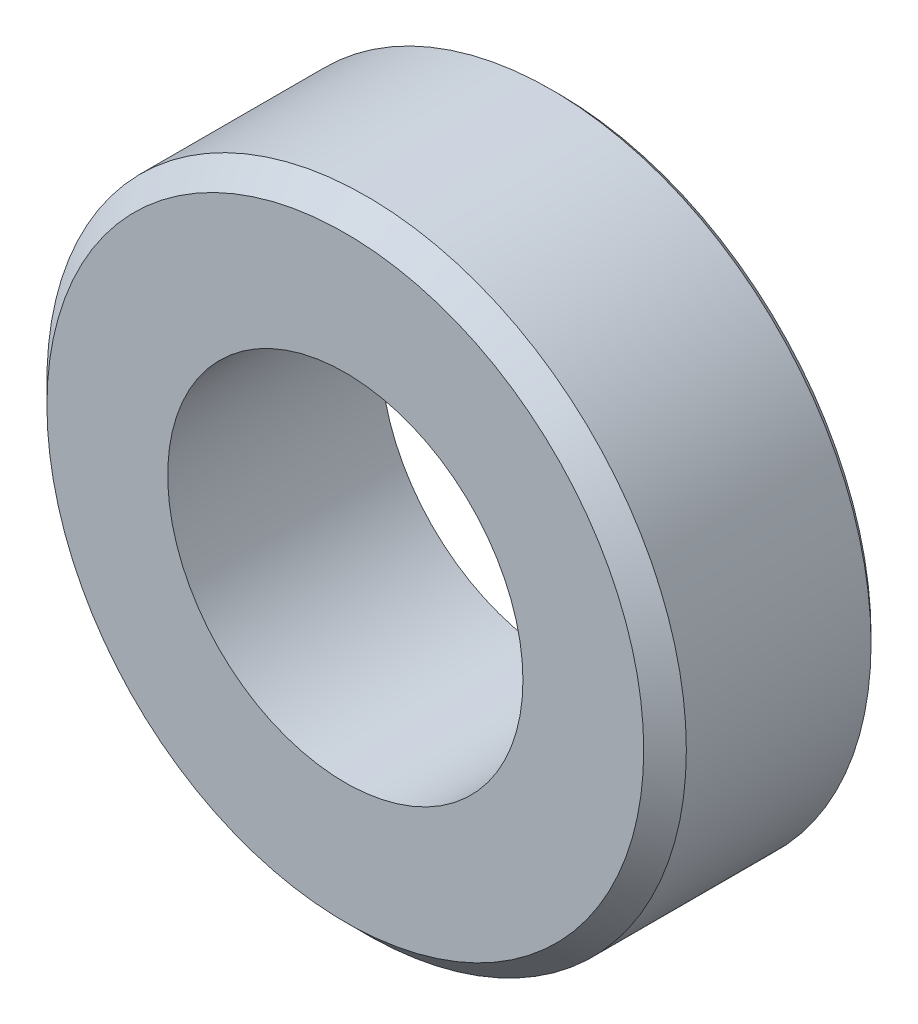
ISO-10303-21;
HEADER;
FILE_DESCRIPTION(('STEP AP214'),'2;1');
FILE_NAME('part.step','',(''),(''),'','','');
FILE_SCHEMA(('AUTOMOTIVE_DESIGN { 1 0 10303 214 1 1 1 1 }'));
ENDSEC;
DATA;
#1=APPLICATION_CONTEXT('core data for automotive mechanical design processes');
#2=APPLICATION_PROTOCOL_DEFINITION('international standard','automotive_design',2000,#1);
#3=PRODUCT_CONTEXT('',#1,'mechanical');
#4=PRODUCT('Part','Part','',(#3));
#5=PRODUCT_RELATED_PRODUCT_CATEGORY('part','',(#4));
#6=PRODUCT_DEFINITION_FORMATION('','',#4);
#7=PRODUCT_DEFINITION_CONTEXT('part definition',#1,'design');
#8=PRODUCT_DEFINITION('design','',#6,#7);
#9=PRODUCT_DEFINITION_SHAPE('','',#8);
#10=(LENGTH_UNIT() NAMED_UNIT(*) SI_UNIT(.MILLI.,.METRE.));
#11=(NAMED_UNIT(*) PLANE_ANGLE_UNIT() SI_UNIT($,.RADIAN.));
#12=(NAMED_UNIT(*) SI_UNIT($,.STERADIAN.) SOLID_ANGLE_UNIT());
#13=UNCERTAINTY_MEASURE_WITH_UNIT(LENGTH_MEASURE(1.E-05),#10,'distance_accuracy_value','');
#14=(GEOMETRIC_REPRESENTATION_CONTEXT(3) GLOBAL_UNCERTAINTY_ASSIGNED_CONTEXT((#13)) GLOBAL_UNIT_ASSIGNED_CONTEXT((#10,
#11,#12)) REPRESENTATION_CONTEXT('',''));
#15=CARTESIAN_POINT('',(0.,0.,0.));
#16=DIRECTION('',(0.,0.,1.));
#17=DIRECTION('',(1.,0.,0.));
#18=AXIS2_PLACEMENT_3D('',#15,#16,#17);
#19=CARTESIAN_POINT('',(0.,0.,15.));
#20=DIRECTION('',(0.,0.,-1.));
#21=DIRECTION('',(-1.,0.,0.));
#22=AXIS2_PLACEMENT_3D('',#19,#20,#21);
#23=CYLINDRICAL_SURFACE('',#22,22.5);
#24=CARTESIAN_POINT('',(0.,0.,13.5));
#25=DIRECTION('',(0.,0.,1.));
#26=DIRECTION('',(1.,0.,0.));
#27=AXIS2_PLACEMENT_3D('',#24,#25,#26);
#28=CIRCLE('',#27,22.5);
#29=CARTESIAN_POINT('',(22.5,0.,13.5));
#30=VERTEX_POINT('',#29);
#31=EDGE_CURVE('E8',#30,#30,#28,.F.);
#32=ORIENTED_EDGE('',*,*,#31,.T.);
#33=EDGE_LOOP('',(#32));
#34=FACE_BOUND('',#33,.T.);
#35=CARTESIAN_POINT('',(0.,0.,0.499999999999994));
#36=DIRECTION('',(0.,0.,1.));
#37=DIRECTION('',(1.,0.,0.));
#38=AXIS2_PLACEMENT_3D('',#35,#36,#37);
#39=CIRCLE('',#38,22.5);
#40=CARTESIAN_POINT('',(22.5,0.,0.499999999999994));
#41=VERTEX_POINT('',#40);
#42=EDGE_CURVE('E27',#41,#41,#39,.T.);
#43=ORIENTED_EDGE('',*,*,#42,.T.);
#44=EDGE_LOOP('',(#43));
#45=FACE_BOUND('',#44,.T.);
#46=ADVANCED_FACE('F12',(#34,#45),#23,.T.);
#47=CARTESIAN_POINT('',(0.,0.,15.));
#48=DIRECTION('',(0.,0.,1.));
#49=DIRECTION('',(1.,0.,0.));
#50=AXIS2_PLACEMENT_3D('',#47,#48,#49);
#51=PLANE('',#50);
#52=CARTESIAN_POINT('',(0.,0.,15.));
#53=DIRECTION('',(0.,0.,1.));
#54=DIRECTION('',(1.,0.,0.));
#55=AXIS2_PLACEMENT_3D('',#52,#53,#54);
#56=CIRCLE('',#55,21.);
#57=CARTESIAN_POINT('',(21.,0.,15.));
#58=VERTEX_POINT('',#57);
#59=EDGE_CURVE('E19',#58,#58,#56,.T.);
#60=ORIENTED_EDGE('',*,*,#59,.T.);
#61=EDGE_LOOP('',(#60));
#62=FACE_BOUND('',#61,.T.);
#63=CARTESIAN_POINT('',(0.,0.,15.));
#64=DIRECTION('',(0.,0.,1.));
#65=DIRECTION('',(1.,0.,0.));
#66=AXIS2_PLACEMENT_3D('',#63,#64,#65);
#67=CIRCLE('',#66,12.5);
#68=CARTESIAN_POINT('',(12.5,0.,15.));
#69=VERTEX_POINT('',#68);
#70=EDGE_CURVE('E35',#69,#69,#67,.T.);
#71=ORIENTED_EDGE('',*,*,#70,.F.);
#72=EDGE_LOOP('',(#71));
#73=FACE_BOUND('',#72,.T.);
#74=ADVANCED_FACE('F41',(#62,#73),#51,.T.);
#75=CARTESIAN_POINT('',(0.,0.,0.));
#76=DIRECTION('',(0.,0.,1.));
#77=DIRECTION('',(1.,0.,0.));
#78=AXIS2_PLACEMENT_3D('',#75,#76,#77);
#79=PLANE('',#78);
#80=CARTESIAN_POINT('',(0.,0.,0.));
#81=DIRECTION('',(0.,0.,1.));
#82=DIRECTION('',(1.,0.,0.));
#83=AXIS2_PLACEMENT_3D('',#80,#81,#82);
#84=CIRCLE('',#83,22.);
#85=CARTESIAN_POINT('',(22.,0.,0.));
#86=VERTEX_POINT('',#85);
#87=EDGE_CURVE('E23',#86,#86,#84,.F.);
#88=ORIENTED_EDGE('',*,*,#87,.T.);
#89=EDGE_LOOP('',(#88));
#90=FACE_BOUND('',#89,.T.);
#91=CARTESIAN_POINT('',(0.,0.,0.));
#92=DIRECTION('',(0.,0.,1.));
#93=DIRECTION('',(1.,0.,0.));
#94=AXIS2_PLACEMENT_3D('',#91,#92,#93);
#95=CIRCLE('',#94,12.5);
#96=CARTESIAN_POINT('',(12.5,0.,0.));
#97=VERTEX_POINT('',#96);
#98=EDGE_CURVE('E32',#97,#97,#95,.T.);
#99=ORIENTED_EDGE('',*,*,#98,.T.);
#100=EDGE_LOOP('',(#99));
#101=FACE_BOUND('',#100,.T.);
#102=ADVANCED_FACE('F43',(#90,#101),#79,.F.);
#103=CARTESIAN_POINT('',(0.,0.,0.));
#104=DIRECTION('',(0.,0.,1.));
#105=DIRECTION('',(1.,0.,0.));
#106=AXIS2_PLACEMENT_3D('',#103,#104,#105);
#107=CYLINDRICAL_SURFACE('',#106,12.5);
#108=ORIENTED_EDGE('',*,*,#98,.F.);
#109=EDGE_LOOP('',(#108));
#110=FACE_BOUND('',#109,.T.);
#111=ORIENTED_EDGE('',*,*,#70,.T.);
#112=EDGE_LOOP('',(#111));
#113=FACE_BOUND('',#112,.T.);
#114=ADVANCED_FACE('F39',(#110,#113),#107,.F.);
#115=CARTESIAN_POINT('',(0.,0.,0.499999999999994));
#116=DIRECTION('',(0.,0.,1.));
#117=DIRECTION('',(1.,0.,0.));
#118=AXIS2_PLACEMENT_3D('',#115,#116,#117);
#119=CONICAL_SURFACE('',#118,22.5,0.785398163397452);
#120=ORIENTED_EDGE('',*,*,#87,.F.);
#121=EDGE_LOOP('',(#120));
#122=FACE_BOUND('',#121,.T.);
#123=ORIENTED_EDGE('',*,*,#42,.F.);
#124=EDGE_LOOP('',(#123));
#125=FACE_BOUND('',#124,.T.);
#126=ADVANCED_FACE('F55',(#122,#125),#119,.T.);
#127=CARTESIAN_POINT('',(0.,0.,15.));
#128=DIRECTION('',(0.,0.,-1.));
#129=DIRECTION('',(-1.,0.,0.));
#130=AXIS2_PLACEMENT_3D('',#127,#128,#129);
#131=CONICAL_SURFACE('',#130,21.,0.785398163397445);
#132=ORIENTED_EDGE('',*,*,#31,.F.);
#133=EDGE_LOOP('',(#132));
#134=FACE_BOUND('',#133,.T.);
#135=ORIENTED_EDGE('',*,*,#59,.F.);
#136=EDGE_LOOP('',(#135));
#137=FACE_BOUND('',#136,.T.);
#138=ADVANCED_FACE('F14',(#134,#137),#131,.T.);
#139=CLOSED_SHELL('',(#46,#74,#102,#114,#126,#138));
#140=MANIFOLD_SOLID_BREP('B1',#139);
#141=ADVANCED_BREP_SHAPE_REPRESENTATION('',(#18,#140),#14);
#142=SHAPE_DEFINITION_REPRESENTATION(#9,#141);
ENDSEC;
END-ISO-10303-21;
